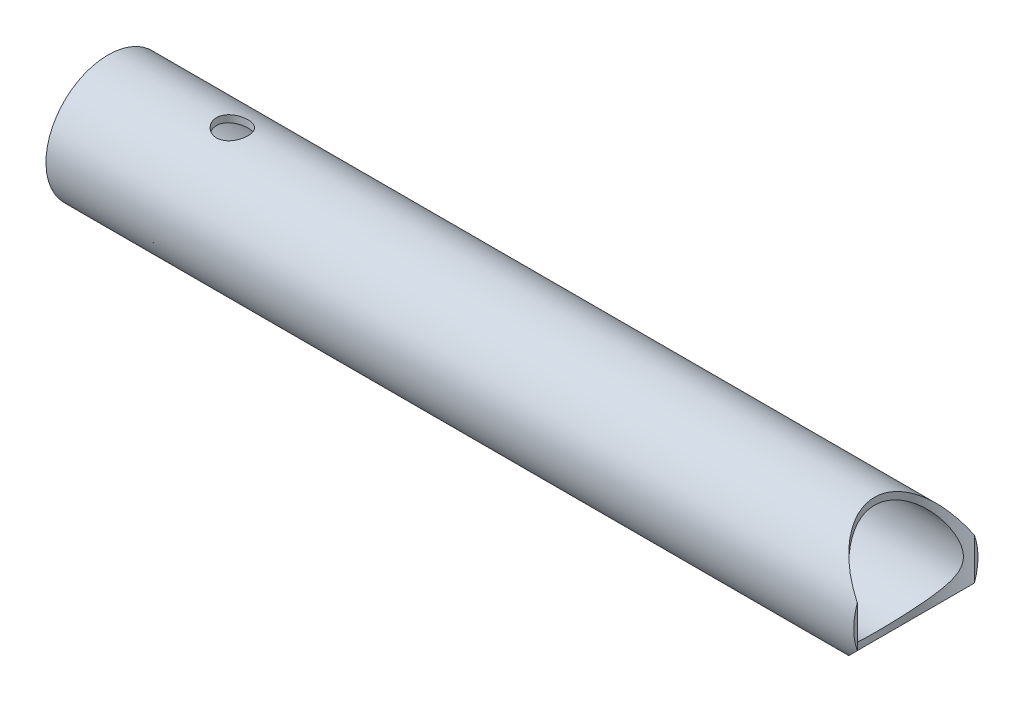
ISO-10303-21;
HEADER;
FILE_DESCRIPTION(('STEP AP214'),'2;1');
FILE_NAME('part.step','',(''),(''),'','','');
FILE_SCHEMA(('AUTOMOTIVE_DESIGN { 1 0 10303 214 1 1 1 1 }'));
ENDSEC;
DATA;
#1=APPLICATION_CONTEXT('core data for automotive mechanical design processes');
#2=APPLICATION_PROTOCOL_DEFINITION('international standard','automotive_design',2000,#1);
#3=PRODUCT_CONTEXT('',#1,'mechanical');
#4=PRODUCT('Part','Part','',(#3));
#5=PRODUCT_RELATED_PRODUCT_CATEGORY('part','',(#4));
#6=PRODUCT_DEFINITION_FORMATION('','',#4);
#7=PRODUCT_DEFINITION_CONTEXT('part definition',#1,'design');
#8=PRODUCT_DEFINITION('design','',#6,#7);
#9=PRODUCT_DEFINITION_SHAPE('','',#8);
#10=(LENGTH_UNIT() NAMED_UNIT(*) SI_UNIT(.MILLI.,.METRE.));
#11=(NAMED_UNIT(*) PLANE_ANGLE_UNIT() SI_UNIT($,.RADIAN.));
#12=(NAMED_UNIT(*) SI_UNIT($,.STERADIAN.) SOLID_ANGLE_UNIT());
#13=UNCERTAINTY_MEASURE_WITH_UNIT(LENGTH_MEASURE(1.E-05),#10,'distance_accuracy_value','');
#14=(GEOMETRIC_REPRESENTATION_CONTEXT(3) GLOBAL_UNCERTAINTY_ASSIGNED_CONTEXT((#13)) GLOBAL_UNIT_ASSIGNED_CONTEXT((#10,
#11,#12)) REPRESENTATION_CONTEXT('',''));
#15=CARTESIAN_POINT('',(0.,0.,0.));
#16=DIRECTION('',(0.,0.,1.));
#17=DIRECTION('',(1.,0.,0.));
#18=AXIS2_PLACEMENT_3D('',#15,#16,#17);
#19=CARTESIAN_POINT('',(123.825,0.,0.));
#20=DIRECTION('',(1.,0.,0.));
#21=DIRECTION('',(0.,0.,-1.));
#22=AXIS2_PLACEMENT_3D('',#19,#20,#21);
#23=PLANE('',#22);
#24=DIRECTION('',(0.,1.,0.));
#25=VECTOR('',#24,1.);
#26=CARTESIAN_POINT('',(123.825,-19.05,-17.9605122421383));
#27=LINE('',#26,#25);
#28=CARTESIAN_POINT('',(123.825,-6.34999999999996,-17.9605122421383));
#29=VERTEX_POINT('',#28);
#30=CARTESIAN_POINT('',(123.825,6.34999999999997,-17.9605122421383));
#31=VERTEX_POINT('',#30);
#32=EDGE_CURVE('E66',#29,#31,#27,.T.);
#33=ORIENTED_EDGE('',*,*,#32,.F.);
#34=CARTESIAN_POINT('',(123.825,0.,0.));
#35=DIRECTION('',(1.,0.,0.));
#36=DIRECTION('',(0.,0.,-1.));
#37=AXIS2_PLACEMENT_3D('',#34,#35,#36);
#38=CIRCLE('',#37,19.05);
#39=EDGE_CURVE('E44',#29,#31,#38,.T.);
#40=ORIENTED_EDGE('',*,*,#39,.T.);
#41=EDGE_LOOP('',(#33,#40));
#42=FACE_BOUND('',#41,.T.);
#43=ADVANCED_FACE('F30',(#42),#23,.T.);
#44=DIRECTION('',(0.,1.,0.));
#45=VECTOR('',#44,1.);
#46=CARTESIAN_POINT('',(123.825,-19.05,17.9605122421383));
#47=LINE('',#46,#45);
#48=CARTESIAN_POINT('',(123.825,-6.34999999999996,17.9605122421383));
#49=VERTEX_POINT('',#48);
#50=CARTESIAN_POINT('',(123.825,6.34999999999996,17.9605122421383));
#51=VERTEX_POINT('',#50);
#52=EDGE_CURVE('E68',#49,#51,#47,.T.);
#53=ORIENTED_EDGE('',*,*,#52,.T.);
#54=EDGE_CURVE('E11',#51,#49,#38,.T.);
#55=ORIENTED_EDGE('',*,*,#54,.T.);
#56=EDGE_LOOP('',(#53,#55));
#57=FACE_BOUND('',#56,.T.);
#58=ADVANCED_FACE('F114',(#57),#23,.T.);
#59=CARTESIAN_POINT('',(-123.825,0.,0.));
#60=DIRECTION('',(1.,0.,0.));
#61=DIRECTION('',(0.,0.,-1.));
#62=AXIS2_PLACEMENT_3D('',#59,#60,#61);
#63=PLANE('',#62);
#64=CARTESIAN_POINT('',(-123.825,0.,0.));
#65=DIRECTION('',(1.,0.,0.));
#66=DIRECTION('',(0.,0.,-1.));
#67=AXIS2_PLACEMENT_3D('',#64,#65,#66);
#68=CIRCLE('',#67,19.05);
#69=CARTESIAN_POINT('',(-123.825,0.,-19.05));
#70=VERTEX_POINT('',#69);
#71=EDGE_CURVE('E75',#70,#70,#68,.T.);
#72=ORIENTED_EDGE('',*,*,#71,.F.);
#73=EDGE_LOOP('',(#72));
#74=FACE_BOUND('',#73,.T.);
#75=CARTESIAN_POINT('',(-123.825,0.,0.));
#76=DIRECTION('',(1.,0.,0.));
#77=DIRECTION('',(0.,0.,-1.));
#78=AXIS2_PLACEMENT_3D('',#75,#76,#77);
#79=CIRCLE('',#78,16.9418);
#80=CARTESIAN_POINT('',(-123.825,0.,-16.9418));
#81=VERTEX_POINT('',#80);
#82=EDGE_CURVE('E69',#81,#81,#79,.T.);
#83=ORIENTED_EDGE('',*,*,#82,.T.);
#84=EDGE_LOOP('',(#83));
#85=FACE_BOUND('',#84,.T.);
#86=ADVANCED_FACE('F116',(#74,#85),#63,.F.);
#87=CARTESIAN_POINT('',(123.825,0.,0.));
#88=DIRECTION('',(-1.,0.,0.));
#89=DIRECTION('',(0.,0.,1.));
#90=AXIS2_PLACEMENT_3D('',#87,#88,#89);
#91=CYLINDRICAL_SURFACE('',#90,19.05);
#92=CARTESIAN_POINT('',(-90.551,-19.05,0.));
#93=CARTESIAN_POINT('',(-90.550992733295,-19.0499955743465,0.266523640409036));
#94=CARTESIAN_POINT('',(-90.528846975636,-19.044351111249,0.533127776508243));
#95=CARTESIAN_POINT('',(-90.4409864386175,-19.0223814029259,1.05868748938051));
#96=CARTESIAN_POINT('',(-90.3752476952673,-19.0060502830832,1.31763877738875));
#97=CARTESIAN_POINT('',(-90.2024516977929,-18.9645145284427,1.82022799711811));
#98=CARTESIAN_POINT('',(-90.0954447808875,-18.939320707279,2.06388416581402));
#99=CARTESIAN_POINT('',(-89.8433289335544,-18.8827386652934,2.52978809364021));
#100=CARTESIAN_POINT('',(-89.6982184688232,-18.8513501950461,2.7520349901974));
#101=CARTESIAN_POINT('',(-89.3707801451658,-18.7850421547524,3.1735020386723));
#102=CARTESIAN_POINT('',(-89.1877990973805,-18.7500669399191,3.3722059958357));
#103=CARTESIAN_POINT('',(-88.7912118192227,-18.6808945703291,3.73645917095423));
#104=CARTESIAN_POINT('',(-88.577602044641,-18.6466975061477,3.90200454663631));
#105=CARTESIAN_POINT('',(-88.1217909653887,-18.5823907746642,4.19768639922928));
#106=CARTESIAN_POINT('',(-87.879202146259,-18.5523516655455,4.32724224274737));
#107=CARTESIAN_POINT('',(-87.3748040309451,-18.5005747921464,4.5435323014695));
#108=CARTESIAN_POINT('',(-87.1129979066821,-18.4788356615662,4.63027356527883));
#109=CARTESIAN_POINT('',(-86.5832810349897,-18.44669254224,4.75670501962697));
#110=CARTESIAN_POINT('',(-86.3156060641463,-18.4360649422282,4.79732487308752));
#111=CARTESIAN_POINT('',(-85.7770461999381,-18.4266790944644,4.83325673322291));
#112=CARTESIAN_POINT('',(-85.5061618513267,-18.4279188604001,4.82857632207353));
#113=CARTESIAN_POINT('',(-84.9760231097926,-18.4419268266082,4.77478153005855));
#114=CARTESIAN_POINT('',(-84.7166471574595,-18.4544067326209,4.72677825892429));
#115=CARTESIAN_POINT('',(-84.2097555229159,-18.4890289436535,4.58947423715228));
#116=CARTESIAN_POINT('',(-83.9622407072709,-18.5111719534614,4.5001704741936));
#117=CARTESIAN_POINT('',(-83.4831342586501,-18.5628878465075,4.28186174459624));
#118=CARTESIAN_POINT('',(-83.2517335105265,-18.592535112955,4.15245621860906));
#119=CARTESIAN_POINT('',(-82.8135343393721,-18.6558774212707,3.85789731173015));
#120=CARTESIAN_POINT('',(-82.6067403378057,-18.6895731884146,3.69273752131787));
#121=CARTESIAN_POINT('',(-82.2172611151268,-18.7584270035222,3.32561742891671));
#122=CARTESIAN_POINT('',(-82.0354601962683,-18.7935989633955,3.12272037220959));
#123=CARTESIAN_POINT('',(-81.7082937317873,-18.8605525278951,2.68889519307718));
#124=CARTESIAN_POINT('',(-81.5629293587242,-18.8923340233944,2.45796616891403));
#125=CARTESIAN_POINT('',(-81.3124251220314,-18.9490909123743,1.97334955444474));
#126=CARTESIAN_POINT('',(-81.2074320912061,-18.9740413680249,1.71958295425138));
#127=CARTESIAN_POINT('',(-81.0418441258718,-19.0141438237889,1.19722795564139));
#128=CARTESIAN_POINT('',(-80.9812404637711,-19.0292977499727,0.928642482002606));
#129=CARTESIAN_POINT('',(-80.9075094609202,-19.0478134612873,0.391831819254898));
#130=CARTESIAN_POINT('',(-80.8931782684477,-19.0514741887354,0.123782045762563));
#131=CARTESIAN_POINT('',(-80.9090927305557,-19.0474440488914,-0.410886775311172));
#132=CARTESIAN_POINT('',(-80.9393342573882,-19.0397542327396,-0.677505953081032));
#133=CARTESIAN_POINT('',(-81.0425443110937,-19.0140789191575,-1.19753978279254));
#134=CARTESIAN_POINT('',(-81.1148532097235,-18.9962524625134,-1.45109391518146));
#135=CARTESIAN_POINT('',(-81.2993895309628,-18.9523154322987,-1.94245802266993));
#136=CARTESIAN_POINT('',(-81.4116210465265,-18.926204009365,-2.18026638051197));
#137=CARTESIAN_POINT('',(-81.6751302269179,-18.867880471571,-2.63815632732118));
#138=CARTESIAN_POINT('',(-81.827078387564,-18.8355664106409,-2.85783875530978));
#139=CARTESIAN_POINT('',(-82.1648533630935,-18.7685780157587,-3.26901378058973));
#140=CARTESIAN_POINT('',(-82.3506861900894,-18.7339032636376,-3.46050136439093));
#141=CARTESIAN_POINT('',(-82.7565508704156,-18.6650207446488,-3.81483413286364));
#142=CARTESIAN_POINT('',(-82.9773278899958,-18.6308468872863,-3.9768338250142));
#143=CARTESIAN_POINT('',(-83.4436408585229,-18.5678096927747,-4.26148813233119));
#144=CARTESIAN_POINT('',(-83.6891757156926,-18.5389461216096,-4.38414448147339));
#145=CARTESIAN_POINT('',(-84.196730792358,-18.4901188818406,-4.58571306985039));
#146=CARTESIAN_POINT('',(-84.4586429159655,-18.4701027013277,-4.6648841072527));
#147=CARTESIAN_POINT('',(-84.99264692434,-18.4411928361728,-4.77790476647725));
#148=CARTESIAN_POINT('',(-85.2647364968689,-18.4322966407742,-4.81176461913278));
#149=CARTESIAN_POINT('',(-85.8027580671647,-18.4268290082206,-4.83265643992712));
#150=CARTESIAN_POINT('',(-86.0686347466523,-18.4299015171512,-4.8210411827));
#151=CARTESIAN_POINT('',(-86.5945056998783,-18.4471998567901,-4.75441673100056));
#152=CARTESIAN_POINT('',(-86.8545000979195,-18.4614254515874,-4.69940845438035));
#153=CARTESIAN_POINT('',(-87.3597101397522,-18.4992259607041,-4.54830738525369));
#154=CARTESIAN_POINT('',(-87.6050083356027,-18.5227416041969,-4.45247475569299));
#155=CARTESIAN_POINT('',(-88.0762220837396,-18.576479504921,-4.22265020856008));
#156=CARTESIAN_POINT('',(-88.3021348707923,-18.6067027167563,-4.08865285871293));
#157=CARTESIAN_POINT('',(-88.734686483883,-18.6714602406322,-3.78208916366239));
#158=CARTESIAN_POINT('',(-88.9406482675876,-18.7060882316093,-3.60858717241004));
#159=CARTESIAN_POINT('',(-89.3209736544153,-18.7752016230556,-3.22975405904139));
#160=CARTESIAN_POINT('',(-89.4953297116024,-18.8096869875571,-3.02441535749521));
#161=CARTESIAN_POINT('',(-89.810684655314,-18.8754008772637,-2.58309455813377));
#162=CARTESIAN_POINT('',(-89.9509973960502,-18.9065562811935,-2.34661043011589));
#163=CARTESIAN_POINT('',(-90.1896527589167,-18.9613231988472,-1.85263998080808));
#164=CARTESIAN_POINT('',(-90.2880248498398,-18.9849400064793,-1.59516855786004));
#165=CARTESIAN_POINT('',(-90.4257473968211,-19.0185620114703,-1.11520835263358));
#166=CARTESIAN_POINT('',(-90.4726141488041,-19.0302693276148,-0.894965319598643));
#167=CARTESIAN_POINT('',(-90.5352422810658,-19.045989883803,-0.44983372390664));
#168=CARTESIAN_POINT('',(-90.5510061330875,-19.0500037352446,-0.224945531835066));
#169=CARTESIAN_POINT('',(-90.551,-19.05,0.));
#170=B_SPLINE_CURVE_WITH_KNOTS('',3,(#92,#93,#94,#95,#96,#97,#98,#99,#100,#101,#102,#103,#104,
#105,#106,#107,#108,#109,#110,#111,#112,#113,#114,#115,#116,#117,#118,#119,#120,#121,#122,#123,
#124,#125,#126,#127,#128,#129,#130,#131,#132,#133,#134,#135,#136,#137,#138,#139,#140,#141,#142,
#143,#144,#145,#146,#147,#148,#149,#150,#151,#152,#153,#154,#155,#156,#157,#158,#159,#160,#161,
#162,#163,#164,#165,#166,#167,#168,#169),.UNSPECIFIED.,.T.,.F.,(4,2,2,2,2,2,2,2,2,2,2,2,2,2,2,2,
2,2,2,2,2,2,2,2,2,2,2,2,2,2,2,2,2,2,2,2,2,2,4),(0.,0.798746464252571,1.59793238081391,
2.39614655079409,3.19439286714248,4.00776667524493,4.8212346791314,5.64715125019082,
6.47293180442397,7.28175406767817,8.09044095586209,8.87895891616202,9.66753439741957,
10.4642553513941,11.2611192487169,12.0813397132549,12.9015865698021,13.7247891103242,
14.5478297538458,15.3492775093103,16.1506510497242,16.9397851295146,17.7290001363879,
18.5325118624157,19.3361662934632,20.1601169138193,20.9840312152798,21.8029874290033,
22.6217586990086,23.4163612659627,24.21094702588,25.0005431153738,25.7902516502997,
26.6010800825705,27.4121018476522,28.2383181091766,29.0639528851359,29.7381472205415,
30.4122879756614),.UNSPECIFIED.);
#171=CARTESIAN_POINT('',(-90.551,-19.05,0.));
#172=VERTEX_POINT('',#171);
#173=EDGE_CURVE('E107',#172,#172,#170,.T.);
#174=ORIENTED_EDGE('',*,*,#173,.T.);
#175=EDGE_LOOP('',(#174));
#176=FACE_BOUND('',#175,.T.);
#177=CARTESIAN_POINT('',(-85.725,18.4285708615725,4.82599999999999));
#178=CARTESIAN_POINT('',(-85.9913688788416,18.4285758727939,4.82599264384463));
#179=CARTESIAN_POINT('',(-86.2578184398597,18.4344091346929,4.80387171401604));
#180=CARTESIAN_POINT('',(-86.7830575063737,18.457050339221,4.71611871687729));
#181=CARTESIAN_POINT('',(-87.0418425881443,18.4738644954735,4.65046201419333));
#182=CARTESIAN_POINT('',(-87.5440792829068,18.5164437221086,4.47790575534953));
#183=CARTESIAN_POINT('',(-87.7875505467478,18.5421970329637,4.37106036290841));
#184=CARTESIAN_POINT('',(-88.253141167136,18.5997381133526,4.11932558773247));
#185=CARTESIAN_POINT('',(-88.4752594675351,18.6315261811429,3.97443432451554));
#186=CARTESIAN_POINT('',(-88.8968569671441,18.6983591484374,3.64722361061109));
#187=CARTESIAN_POINT('',(-89.0957825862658,18.7334572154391,3.46420161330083));
#188=CARTESIAN_POINT('',(-89.4604677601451,18.8024947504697,3.06743753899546));
#189=CARTESIAN_POINT('',(-89.6262241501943,18.836434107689,2.85369253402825));
#190=CARTESIAN_POINT('',(-89.9221390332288,18.8999194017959,2.39774842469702));
#191=CARTESIAN_POINT('',(-90.0517524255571,18.9293952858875,2.15518494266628));
#192=CARTESIAN_POINT('',(-90.2681556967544,18.9800252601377,1.65084105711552));
#193=CARTESIAN_POINT('',(-90.3549520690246,19.0011806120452,1.38906357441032));
#194=CARTESIAN_POINT('',(-90.4814807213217,19.0324100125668,0.859495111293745));
#195=CARTESIAN_POINT('',(-90.5221533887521,19.0427051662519,0.591942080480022));
#196=CARTESIAN_POINT('',(-90.5582332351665,19.0518251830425,0.0536254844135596));
#197=CARTESIAN_POINT('',(-90.553647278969,19.0506517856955,-0.217137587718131));
#198=CARTESIAN_POINT('',(-90.5000136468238,19.0371309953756,-0.747661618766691));
#199=CARTESIAN_POINT('',(-90.4519812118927,19.0250387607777,-1.00753269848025));
#200=CARTESIAN_POINT('',(-90.3144515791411,18.9913368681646,-1.51539893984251));
#201=CARTESIAN_POINT('',(-90.2249521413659,18.9697266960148,-1.76339345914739));
#202=CARTESIAN_POINT('',(-90.0062161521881,18.9190290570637,-2.24312541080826));
#203=CARTESIAN_POINT('',(-89.8766209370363,18.889874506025,-2.47469192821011));
#204=CARTESIAN_POINT('',(-89.5816448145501,18.8272464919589,-2.91314471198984));
#205=CARTESIAN_POINT('',(-89.4162575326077,18.7937722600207,-3.12002657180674));
#206=CARTESIAN_POINT('',(-89.0489598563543,18.7250516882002,-3.50929331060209));
#207=CARTESIAN_POINT('',(-88.8461626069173,18.6897819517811,-3.6908381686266));
#208=CARTESIAN_POINT('',(-88.4126334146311,18.6222939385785,-4.01753343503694));
#209=CARTESIAN_POINT('',(-88.181900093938,18.5900758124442,-4.1626820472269));
#210=CARTESIAN_POINT('',(-87.6973668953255,18.5322530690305,-4.41302198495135));
#211=CARTESIAN_POINT('',(-87.4434555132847,18.5066829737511,-4.5180060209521));
#212=CARTESIAN_POINT('',(-86.920781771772,18.4654913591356,-4.6835332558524));
#213=CARTESIAN_POINT('',(-86.6520227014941,18.4498676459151,-4.74408625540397));
#214=CARTESIAN_POINT('',(-86.1150857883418,18.4307995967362,-4.81762824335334));
#215=CARTESIAN_POINT('',(-85.8470894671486,18.4270367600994,-4.8318614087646));
#216=CARTESIAN_POINT('',(-85.3125496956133,18.4312486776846,-4.81577014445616));
#217=CARTESIAN_POINT('',(-85.0460061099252,18.4392223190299,-4.78544993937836));
#218=CARTESIAN_POINT('',(-84.526591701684,18.4657030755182,-4.68220470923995));
#219=CARTESIAN_POINT('',(-84.2735659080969,18.4840298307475,-4.61000863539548));
#220=CARTESIAN_POINT('',(-83.7832093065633,18.5289796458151,-4.42587148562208));
#221=CARTESIAN_POINT('',(-83.5458804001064,18.5556037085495,-4.31392560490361));
#222=CARTESIAN_POINT('',(-83.0883957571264,18.6148155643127,-4.05087777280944));
#223=CARTESIAN_POINT('',(-82.8686806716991,18.6475123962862,-3.89903454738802));
#224=CARTESIAN_POINT('',(-82.4573921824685,18.7149203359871,-3.56143596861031));
#225=CARTESIAN_POINT('',(-82.2658235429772,18.7496317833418,-3.37567488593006));
#226=CARTESIAN_POINT('',(-81.9112016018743,18.8182406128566,-2.96979489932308));
#227=CARTESIAN_POINT('',(-81.7490103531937,18.8520939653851,-2.74891396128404));
#228=CARTESIAN_POINT('',(-81.46401938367,18.9142478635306,-2.28233090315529));
#229=CARTESIAN_POINT('',(-81.3412175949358,18.9425487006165,-2.03663008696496));
#230=CARTESIAN_POINT('',(-81.1395711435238,18.9902292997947,-1.52908971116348));
#231=CARTESIAN_POINT('',(-81.0604074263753,19.0096736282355,-1.26738326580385));
#232=CARTESIAN_POINT('',(-80.9473322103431,19.0377333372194,-0.733822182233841));
#233=CARTESIAN_POINT('',(-80.9134117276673,19.0463508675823,-0.461969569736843));
#234=CARTESIAN_POINT('',(-80.8923025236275,19.0516955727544,0.0760773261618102));
#235=CARTESIAN_POINT('',(-80.9038431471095,19.0487460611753,0.342219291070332));
#236=CARTESIAN_POINT('',(-80.970410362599,19.0320078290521,0.868641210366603));
#237=CARTESIAN_POINT('',(-81.0254355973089,19.0182194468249,1.12892134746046));
#238=CARTESIAN_POINT('',(-81.1767210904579,18.9814055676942,1.63486230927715));
#239=CARTESIAN_POINT('',(-81.2727460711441,18.9584328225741,1.88059757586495));
#240=CARTESIAN_POINT('',(-81.503092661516,18.9056658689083,2.35260810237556));
#241=CARTESIAN_POINT('',(-81.6374192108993,18.8758707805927,2.57888084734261));
#242=CARTESIAN_POINT('',(-81.944400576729,18.8117551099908,3.011547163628));
#243=CARTESIAN_POINT('',(-82.1179137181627,18.7773415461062,3.21731796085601));
#244=CARTESIAN_POINT('',(-82.4966839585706,18.7082773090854,3.59725312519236));
#245=CARTESIAN_POINT('',(-82.7019491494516,18.6736265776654,3.77140941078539));
#246=CARTESIAN_POINT('',(-83.1431635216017,18.6072484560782,4.08647635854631));
#247=CARTESIAN_POINT('',(-83.379628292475,18.5755903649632,4.22668077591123));
#248=CARTESIAN_POINT('',(-83.8735418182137,18.5197230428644,4.46513853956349));
#249=CARTESIAN_POINT('',(-84.1309754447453,18.4955085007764,4.56342181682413));
#250=CARTESIAN_POINT('',(-84.6107194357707,18.4609727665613,4.70095724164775));
#251=CARTESIAN_POINT('',(-84.8307744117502,18.4489148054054,4.74774455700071));
#252=CARTESIAN_POINT('',(-85.2755340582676,18.4327120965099,4.81026763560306));
#253=CARTESIAN_POINT('',(-85.5002383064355,18.4285666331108,4.82600620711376));
#254=CARTESIAN_POINT('',(-85.725,18.4285708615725,4.82599999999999));
#255=B_SPLINE_CURVE_WITH_KNOTS('',3,(#177,#178,#179,#180,#181,#182,#183,#184,#185,#186,#187,
#188,#189,#190,#191,#192,#193,#194,#195,#196,#197,#198,#199,#200,#201,#202,#203,#204,#205,#206,
#207,#208,#209,#210,#211,#212,#213,#214,#215,#216,#217,#218,#219,#220,#221,#222,#223,#224,#225,
#226,#227,#228,#229,#230,#231,#232,#233,#234,#235,#236,#237,#238,#239,#240,#241,#242,#243,#244,
#245,#246,#247,#248,#249,#250,#251,#252,#253,#254),.UNSPECIFIED.,.T.,.F.,(4,2,2,2,2,2,2,2,2,2,2,
2,2,2,2,2,2,2,2,2,2,2,2,2,2,2,2,2,2,2,2,2,2,2,2,2,2,2,4),(0.,0.79828103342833,1.59701417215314,
2.39470052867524,3.19242631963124,4.00640824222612,4.82046779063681,5.64621187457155,
6.4718306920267,7.28029552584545,8.08863773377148,8.87856548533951,9.66853591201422,
10.465787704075,11.2631816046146,12.0827235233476,12.9023058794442,13.7260628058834,
14.5496379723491,15.3509005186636,16.1520870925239,16.9397286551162,17.7274654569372,
18.5310235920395,19.3347175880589,20.1591226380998,20.9834844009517,21.801736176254,
22.6198254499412,23.4152132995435,24.2105763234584,25.0014352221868,25.792396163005,
26.6027334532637,27.4132775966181,28.2394598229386,29.0650511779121,29.7387005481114,
30.4122889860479),.UNSPECIFIED.);
#256=CARTESIAN_POINT('',(-85.725,18.4285708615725,4.82599999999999));
#257=VERTEX_POINT('',#256);
#258=EDGE_CURVE('E103',#257,#257,#255,.T.);
#259=ORIENTED_EDGE('',*,*,#258,.T.);
#260=EDGE_LOOP('',(#259));
#261=FACE_BOUND('',#260,.T.);
#262=ORIENTED_EDGE('',*,*,#39,.F.);
#263=CARTESIAN_POINT('',(130.175,0.,0.));
#264=DIRECTION('',(-0.707106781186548,0.707106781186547,0.));
#265=DIRECTION('',(-0.707106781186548,-0.707106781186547,0.));
#266=AXIS2_PLACEMENT_3D('',#263,#264,#265);
#267=ELLIPSE('',#266,26.9407683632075,19.05);
#268=EDGE_CURVE('E63',#29,#49,#267,.T.);
#269=ORIENTED_EDGE('',*,*,#268,.T.);
#270=ORIENTED_EDGE('',*,*,#54,.F.);
#271=CARTESIAN_POINT('',(130.175,0.,0.));
#272=DIRECTION('',(-0.707106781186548,-0.707106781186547,0.));
#273=DIRECTION('',(-0.707106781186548,0.707106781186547,0.));
#274=AXIS2_PLACEMENT_3D('',#271,#272,#273);
#275=ELLIPSE('',#274,26.9407683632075,19.05);
#276=EDGE_CURVE('E52',#51,#31,#275,.T.);
#277=ORIENTED_EDGE('',*,*,#276,.T.);
#278=EDGE_LOOP('',(#262,#269,#270,#277));
#279=FACE_BOUND('',#278,.T.);
#280=ORIENTED_EDGE('',*,*,#71,.T.);
#281=EDGE_LOOP('',(#280));
#282=FACE_BOUND('',#281,.T.);
#283=ADVANCED_FACE('F32',(#176,#261,#279,#282),#91,.T.);
#284=CARTESIAN_POINT('',(123.825,0.,0.));
#285=DIRECTION('',(-1.,0.,0.));
#286=DIRECTION('',(0.,0.,1.));
#287=AXIS2_PLACEMENT_3D('',#284,#285,#286);
#288=CYLINDRICAL_SURFACE('',#287,16.9418);
#289=CARTESIAN_POINT('',(-85.725,-16.2398987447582,4.82599999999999));
#290=CARTESIAN_POINT('',(-85.4598918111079,-16.2399025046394,4.82599514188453));
#291=CARTESIAN_POINT('',(-85.1947344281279,-16.2464614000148,4.80408071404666));
#292=CARTESIAN_POINT('',(-84.6721276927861,-16.2718960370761,4.71719958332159));
#293=CARTESIAN_POINT('',(-84.4146815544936,-16.290776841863,4.65221518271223));
#294=CARTESIAN_POINT('',(-83.9151353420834,-16.3385472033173,4.48154425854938));
#295=CARTESIAN_POINT('',(-83.6730122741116,-16.3674213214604,4.37592049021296));
#296=CARTESIAN_POINT('',(-83.2098729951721,-16.431904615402,4.12717112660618));
#297=CARTESIAN_POINT('',(-82.988859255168,-16.4675145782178,3.98404114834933));
#298=CARTESIAN_POINT('',(-82.5679066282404,-16.5425963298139,3.65997227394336));
#299=CARTESIAN_POINT('',(-82.3686591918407,-16.5821440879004,3.47815261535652));
#300=CARTESIAN_POINT('',(-82.0030319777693,-16.659993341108,3.08375626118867));
#301=CARTESIAN_POINT('',(-81.8366560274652,-16.6982946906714,2.87117598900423));
#302=CARTESIAN_POINT('',(-81.5385480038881,-16.7701914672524,2.41643196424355));
#303=CARTESIAN_POINT('',(-81.4075127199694,-16.8036868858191,2.17379423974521));
#304=CARTESIAN_POINT('',(-81.1883660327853,-16.8613202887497,1.66881437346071));
#305=CARTESIAN_POINT('',(-81.1002463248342,-16.8854600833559,1.40647605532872));
#306=CARTESIAN_POINT('',(-80.971696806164,-16.9211249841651,0.876768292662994));
#307=CARTESIAN_POINT('',(-80.9300886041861,-16.9329612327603,0.609706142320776));
#308=CARTESIAN_POINT('',(-80.89202584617,-16.9437774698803,0.0721471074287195));
#309=CARTESIAN_POINT('',(-80.8955627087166,-16.9427599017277,-0.198349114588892));
#310=CARTESIAN_POINT('',(-80.9468804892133,-16.9282068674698,-0.726861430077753));
#311=CARTESIAN_POINT('',(-80.9933867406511,-16.9150320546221,-0.985012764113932));
#312=CARTESIAN_POINT('',(-81.1272517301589,-16.8780771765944,-1.48968266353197));
#313=CARTESIAN_POINT('',(-81.2146129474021,-16.8542964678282,-1.73620052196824));
#314=CARTESIAN_POINT('',(-81.4286236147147,-16.7982862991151,-2.2137399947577));
#315=CARTESIAN_POINT('',(-81.5556905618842,-16.7659676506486,-2.44456361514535));
#316=CARTESIAN_POINT('',(-81.8451803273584,-16.6963353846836,-2.88203234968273));
#317=CARTESIAN_POINT('',(-82.0076108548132,-16.6590206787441,-3.08867217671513));
#318=CARTESIAN_POINT('',(-82.3699022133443,-16.5818770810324,-3.47951747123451));
#319=CARTESIAN_POINT('',(-82.5708713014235,-16.5420058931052,-3.66268859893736));
#320=CARTESIAN_POINT('',(-83.0010765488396,-16.4653984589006,-3.99300254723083));
#321=CARTESIAN_POINT('',(-83.2303149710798,-16.4286624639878,-4.14014248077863));
#322=CARTESIAN_POINT('',(-83.7130479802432,-16.3622969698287,-4.39515661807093));
#323=CARTESIAN_POINT('',(-83.9667197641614,-16.3327258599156,-4.50271168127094));
#324=CARTESIAN_POINT('',(-84.4896052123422,-16.2847439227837,-4.67329038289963));
#325=CARTESIAN_POINT('',(-84.7588143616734,-16.2663298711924,-4.73632688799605));
#326=CARTESIAN_POINT('',(-85.2953673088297,-16.2434450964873,-4.81421663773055));
#327=CARTESIAN_POINT('',(-85.5624658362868,-16.2385235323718,-4.83062851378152));
#328=CARTESIAN_POINT('',(-86.0955988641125,-16.2419403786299,-4.81912863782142));
#329=CARTESIAN_POINT('',(-86.361633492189,-16.2502771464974,-4.79122237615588));
#330=CARTESIAN_POINT('',(-86.8788213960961,-16.278832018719,-4.69326023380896));
#331=CARTESIAN_POINT('',(-87.1301754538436,-16.298775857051,-4.62417646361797));
#332=CARTESIAN_POINT('',(-87.6177187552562,-16.3480210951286,-4.446931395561));
#333=CARTESIAN_POINT('',(-87.8539058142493,-16.3773238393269,-4.33876448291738));
#334=CARTESIAN_POINT('',(-88.3108349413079,-16.4428832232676,-4.08337089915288));
#335=CARTESIAN_POINT('',(-88.531053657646,-16.479293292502,-3.93524822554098));
#336=CARTESIAN_POINT('',(-88.9440805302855,-16.554620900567,-3.60523332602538));
#337=CARTESIAN_POINT('',(-89.1368827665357,-16.5935389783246,-3.42333382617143));
#338=CARTESIAN_POINT('',(-89.4962576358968,-16.6710775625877,-3.02365578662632));
#339=CARTESIAN_POINT('',(-89.6617335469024,-16.7096443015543,-2.80487843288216));
#340=CARTESIAN_POINT('',(-89.9536318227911,-16.7808086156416,-2.34176245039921));
#341=CARTESIAN_POINT('',(-90.0800562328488,-16.8134065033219,-2.09742516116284));
#342=CARTESIAN_POINT('',(-90.2890573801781,-16.8687524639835,-1.59181882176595));
#343=CARTESIAN_POINT('',(-90.3719659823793,-16.8915748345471,-1.3306954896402));
#344=CARTESIAN_POINT('',(-90.4924930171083,-16.9251264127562,-0.797464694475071));
#345=CARTESIAN_POINT('',(-90.5301230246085,-16.9358587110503,-0.525360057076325));
#346=CARTESIAN_POINT('',(-90.558215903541,-16.943852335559,0.01192429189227));
#347=CARTESIAN_POINT('',(-90.550277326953,-16.941570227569,0.277014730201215));
#348=CARTESIAN_POINT('',(-90.4912284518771,-16.924847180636,0.801929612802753));
#349=CARTESIAN_POINT('',(-90.440120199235,-16.9104068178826,1.06175430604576));
#350=CARTESIAN_POINT('',(-90.2971346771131,-16.8711021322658,1.56655424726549));
#351=CARTESIAN_POINT('',(-90.2056217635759,-16.8463310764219,1.8116404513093));
#352=CARTESIAN_POINT('',(-89.9847487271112,-16.7889379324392,2.28311567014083));
#353=CARTESIAN_POINT('',(-89.8553827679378,-16.7563146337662,2.50950179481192));
#354=CARTESIAN_POINT('',(-89.5580238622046,-16.6854717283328,2.94442504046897));
#355=CARTESIAN_POINT('',(-89.3890008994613,-16.6471150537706,3.15223547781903));
#356=CARTESIAN_POINT('',(-89.019026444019,-16.5696185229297,3.53708134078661));
#357=CARTESIAN_POINT('',(-88.8180661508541,-16.5304784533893,3.71410825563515));
#358=CARTESIAN_POINT('',(-88.3836272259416,-16.4546575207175,4.03696749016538));
#359=CARTESIAN_POINT('',(-88.1494375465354,-16.4180673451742,4.18186647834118));
#360=CARTESIAN_POINT('',(-87.6590097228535,-16.3528543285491,4.43004628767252));
#361=CARTESIAN_POINT('',(-87.4027841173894,-16.3242269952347,4.53335058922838));
#362=CARTESIAN_POINT('',(-86.9109649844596,-16.2815559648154,4.68410013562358));
#363=CARTESIAN_POINT('',(-86.6772091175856,-16.2660718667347,4.73717648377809));
#364=CARTESIAN_POINT('',(-86.2039816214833,-16.2452423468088,4.80812587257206));
#365=CARTESIAN_POINT('',(-85.9645108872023,-16.2398953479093,4.82600438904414));
#366=CARTESIAN_POINT('',(-85.725,-16.2398987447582,4.82599999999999));
#367=B_SPLINE_CURVE_WITH_KNOTS('',3,(#289,#290,#291,#292,#293,#294,#295,#296,#297,#298,#299,
#300,#301,#302,#303,#304,#305,#306,#307,#308,#309,#310,#311,#312,#313,#314,#315,#316,#317,#318,
#319,#320,#321,#322,#323,#324,#325,#326,#327,#328,#329,#330,#331,#332,#333,#334,#335,#336,#337,
#338,#339,#340,#341,#342,#343,#344,#345,#346,#347,#348,#349,#350,#351,#352,#353,#354,#355,#356,
#357,#358,#359,#360,#361,#362,#363,#364,#365,#366),.UNSPECIFIED.,.T.,.F.,(4,2,2,2,2,2,2,2,2,2,2,
2,2,2,2,2,2,2,2,2,2,2,2,2,2,2,2,2,2,2,2,2,2,2,2,2,2,2,4),(0.,0.794442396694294,1.58921143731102,
2.38275809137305,3.17639752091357,3.99052759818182,4.80475241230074,5.63401913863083,
6.46312532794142,7.27071277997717,8.07814672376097,8.86237191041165,9.64664469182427,
10.4394583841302,11.2324450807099,12.0531003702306,12.8738213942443,13.701021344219,
14.5279821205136,15.3269529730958,16.1258248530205,16.9065451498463,17.6873776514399,
18.4874323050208,19.2876594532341,20.1147280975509,20.9417534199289,21.7623764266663,
22.5827896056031,23.3746025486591,24.1663779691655,24.9511547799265,25.7360526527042,
26.5441835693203,27.3525375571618,28.1819607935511,29.0109151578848,29.7287625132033,
30.4464981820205),.UNSPECIFIED.);
#368=CARTESIAN_POINT('',(-85.725,-16.2398987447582,4.82599999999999));
#369=VERTEX_POINT('',#368);
#370=EDGE_CURVE('E35',#369,#369,#367,.T.);
#371=ORIENTED_EDGE('',*,*,#370,.F.);
#372=EDGE_LOOP('',(#371));
#373=FACE_BOUND('',#372,.T.);
#374=CARTESIAN_POINT('',(-85.725,16.2398987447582,4.82599999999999));
#375=CARTESIAN_POINT('',(-85.9901081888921,16.2399025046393,4.82599514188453));
#376=CARTESIAN_POINT('',(-86.2552655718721,16.2464614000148,4.80408071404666));
#377=CARTESIAN_POINT('',(-86.7778723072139,16.2718960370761,4.71719958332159));
#378=CARTESIAN_POINT('',(-87.0353184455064,16.290776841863,4.65221518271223));
#379=CARTESIAN_POINT('',(-87.5348646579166,16.3385472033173,4.48154425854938));
#380=CARTESIAN_POINT('',(-87.7769877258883,16.3674213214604,4.37592049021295));
#381=CARTESIAN_POINT('',(-88.2401270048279,16.431904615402,4.12717112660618));
#382=CARTESIAN_POINT('',(-88.461140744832,16.4675145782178,3.98404114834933));
#383=CARTESIAN_POINT('',(-88.8820933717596,16.5425963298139,3.65997227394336));
#384=CARTESIAN_POINT('',(-89.0813408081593,16.5821440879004,3.47815261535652));
#385=CARTESIAN_POINT('',(-89.4469680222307,16.659993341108,3.08375626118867));
#386=CARTESIAN_POINT('',(-89.6133439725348,16.6982946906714,2.87117598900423));
#387=CARTESIAN_POINT('',(-89.9114519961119,16.7701914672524,2.41643196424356));
#388=CARTESIAN_POINT('',(-90.0424872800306,16.8036868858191,2.17379423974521));
#389=CARTESIAN_POINT('',(-90.2616339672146,16.8613202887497,1.66881437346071));
#390=CARTESIAN_POINT('',(-90.3497536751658,16.8854600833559,1.40647605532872));
#391=CARTESIAN_POINT('',(-90.478303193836,16.9211249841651,0.876768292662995));
#392=CARTESIAN_POINT('',(-90.5199113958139,16.9329612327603,0.609706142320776));
#393=CARTESIAN_POINT('',(-90.55797415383,16.9437774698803,0.0721471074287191));
#394=CARTESIAN_POINT('',(-90.5544372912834,16.9427599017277,-0.198349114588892));
#395=CARTESIAN_POINT('',(-90.5031195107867,16.9282068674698,-0.726861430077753));
#396=CARTESIAN_POINT('',(-90.4566132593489,16.9150320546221,-0.985012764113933));
#397=CARTESIAN_POINT('',(-90.3227482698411,16.8780771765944,-1.48968266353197));
#398=CARTESIAN_POINT('',(-90.2353870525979,16.8542964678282,-1.73620052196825));
#399=CARTESIAN_POINT('',(-90.0213763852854,16.7982862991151,-2.2137399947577));
#400=CARTESIAN_POINT('',(-89.8943094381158,16.7659676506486,-2.44456361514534));
#401=CARTESIAN_POINT('',(-89.6048196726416,16.6963353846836,-2.88203234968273));
#402=CARTESIAN_POINT('',(-89.4423891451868,16.6590206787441,-3.08867217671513));
#403=CARTESIAN_POINT('',(-89.0800977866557,16.5818770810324,-3.47951747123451));
#404=CARTESIAN_POINT('',(-88.8791286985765,16.5420058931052,-3.66268859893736));
#405=CARTESIAN_POINT('',(-88.4489234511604,16.4653984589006,-3.99300254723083));
#406=CARTESIAN_POINT('',(-88.2196850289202,16.4286624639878,-4.14014248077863));
#407=CARTESIAN_POINT('',(-87.7369520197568,16.3622969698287,-4.39515661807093));
#408=CARTESIAN_POINT('',(-87.4832802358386,16.3327258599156,-4.50271168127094));
#409=CARTESIAN_POINT('',(-86.9603947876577,16.2847439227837,-4.67329038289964));
#410=CARTESIAN_POINT('',(-86.6911856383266,16.2663298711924,-4.73632688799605));
#411=CARTESIAN_POINT('',(-86.1546326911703,16.2434450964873,-4.81421663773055));
#412=CARTESIAN_POINT('',(-85.8875341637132,16.2385235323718,-4.83062851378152));
#413=CARTESIAN_POINT('',(-85.3544011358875,16.2419403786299,-4.81912863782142));
#414=CARTESIAN_POINT('',(-85.088366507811,16.2502771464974,-4.79122237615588));
#415=CARTESIAN_POINT('',(-84.5711786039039,16.278832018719,-4.69326023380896));
#416=CARTESIAN_POINT('',(-84.3198245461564,16.298775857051,-4.62417646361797));
#417=CARTESIAN_POINT('',(-83.8322812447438,16.3480210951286,-4.446931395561));
#418=CARTESIAN_POINT('',(-83.5960941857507,16.3773238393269,-4.33876448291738));
#419=CARTESIAN_POINT('',(-83.1391650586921,16.4428832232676,-4.08337089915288));
#420=CARTESIAN_POINT('',(-82.918946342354,16.479293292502,-3.93524822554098));
#421=CARTESIAN_POINT('',(-82.5059194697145,16.554620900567,-3.60523332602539));
#422=CARTESIAN_POINT('',(-82.3131172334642,16.5935389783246,-3.42333382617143));
#423=CARTESIAN_POINT('',(-81.9537423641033,16.6710775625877,-3.02365578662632));
#424=CARTESIAN_POINT('',(-81.7882664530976,16.7096443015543,-2.80487843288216));
#425=CARTESIAN_POINT('',(-81.4963681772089,16.7808086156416,-2.34176245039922));
#426=CARTESIAN_POINT('',(-81.3699437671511,16.8134065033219,-2.09742516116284));
#427=CARTESIAN_POINT('',(-81.1609426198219,16.8687524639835,-1.59181882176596));
#428=CARTESIAN_POINT('',(-81.0780340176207,16.8915748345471,-1.33069548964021));
#429=CARTESIAN_POINT('',(-80.9575069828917,16.9251264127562,-0.797464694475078));
#430=CARTESIAN_POINT('',(-80.9198769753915,16.9358587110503,-0.52536005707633));
#431=CARTESIAN_POINT('',(-80.891784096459,16.943852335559,0.0119242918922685));
#432=CARTESIAN_POINT('',(-80.899722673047,16.941570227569,0.277014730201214));
#433=CARTESIAN_POINT('',(-80.9587715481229,16.924847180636,0.801929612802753));
#434=CARTESIAN_POINT('',(-81.009879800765,16.9104068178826,1.06175430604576));
#435=CARTESIAN_POINT('',(-81.1528653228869,16.8711021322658,1.5665542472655));
#436=CARTESIAN_POINT('',(-81.2443782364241,16.8463310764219,1.8116404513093));
#437=CARTESIAN_POINT('',(-81.4652512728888,16.7889379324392,2.28311567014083));
#438=CARTESIAN_POINT('',(-81.5946172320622,16.7563146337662,2.50950179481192));
#439=CARTESIAN_POINT('',(-81.8919761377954,16.6854717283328,2.94442504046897));
#440=CARTESIAN_POINT('',(-82.0609991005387,16.6471150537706,3.15223547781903));
#441=CARTESIAN_POINT('',(-82.4309735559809,16.5696185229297,3.53708134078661));
#442=CARTESIAN_POINT('',(-82.6319338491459,16.5304784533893,3.71410825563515));
#443=CARTESIAN_POINT('',(-83.0663727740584,16.4546575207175,4.03696749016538));
#444=CARTESIAN_POINT('',(-83.3005624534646,16.4180673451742,4.18186647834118));
#445=CARTESIAN_POINT('',(-83.7909902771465,16.3528543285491,4.43004628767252));
#446=CARTESIAN_POINT('',(-84.0472158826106,16.3242269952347,4.53335058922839));
#447=CARTESIAN_POINT('',(-84.5390350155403,16.2815559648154,4.68410013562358));
#448=CARTESIAN_POINT('',(-84.7727908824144,16.2660718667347,4.73717648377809));
#449=CARTESIAN_POINT('',(-85.2460183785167,16.2452423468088,4.80812587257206));
#450=CARTESIAN_POINT('',(-85.4854891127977,16.2398953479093,4.82600438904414));
#451=CARTESIAN_POINT('',(-85.725,16.2398987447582,4.82599999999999));
#452=B_SPLINE_CURVE_WITH_KNOTS('',3,(#374,#375,#376,#377,#378,#379,#380,#381,#382,#383,#384,
#385,#386,#387,#388,#389,#390,#391,#392,#393,#394,#395,#396,#397,#398,#399,#400,#401,#402,#403,
#404,#405,#406,#407,#408,#409,#410,#411,#412,#413,#414,#415,#416,#417,#418,#419,#420,#421,#422,
#423,#424,#425,#426,#427,#428,#429,#430,#431,#432,#433,#434,#435,#436,#437,#438,#439,#440,#441,
#442,#443,#444,#445,#446,#447,#448,#449,#450,#451),.UNSPECIFIED.,.T.,.F.,(4,2,2,2,2,2,2,2,2,2,2,
2,2,2,2,2,2,2,2,2,2,2,2,2,2,2,2,2,2,2,2,2,2,2,2,2,2,2,4),(0.,0.794442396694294,1.58921143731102,
2.38275809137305,3.17639752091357,3.99052759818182,4.80475241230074,5.63401913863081,
6.46312532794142,7.27071277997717,8.07814672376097,8.86237191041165,9.64664469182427,
10.4394583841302,11.2324450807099,12.0531003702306,12.8738213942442,13.701021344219,
14.5279821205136,15.3269529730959,16.1258248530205,16.9065451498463,17.6873776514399,
18.4874323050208,19.2876594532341,20.1147280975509,20.9417534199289,21.7623764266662,
22.5827896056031,23.3746025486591,24.1663779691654,24.9511547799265,25.7360526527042,
26.5441835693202,27.3525375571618,28.1819607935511,29.0109151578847,29.7287625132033,
30.4464981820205),.UNSPECIFIED.);
#453=CARTESIAN_POINT('',(-85.725,16.2398987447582,4.82599999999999));
#454=VERTEX_POINT('',#453);
#455=EDGE_CURVE('E84',#454,#454,#452,.T.);
#456=ORIENTED_EDGE('',*,*,#455,.F.);
#457=EDGE_LOOP('',(#456));
#458=FACE_BOUND('',#457,.T.);
#459=CARTESIAN_POINT('',(121.464207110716,0.,16.9418));
#460=CARTESIAN_POINT('',(121.464202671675,0.262189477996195,16.9417986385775));
#461=CARTESIAN_POINT('',(121.452301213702,0.52439999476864,16.9356945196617));
#462=CARTESIAN_POINT('',(121.405461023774,1.04618299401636,16.9114858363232));
#463=CARTESIAN_POINT('',(121.370518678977,1.30575505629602,16.8933793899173));
#464=CARTESIAN_POINT('',(121.279565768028,1.82080221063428,16.8456631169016));
#465=CARTESIAN_POINT('',(121.223496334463,2.07626375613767,16.8160211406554));
#466=CARTESIAN_POINT('',(121.093144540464,2.58103055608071,16.7459805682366));
#467=CARTESIAN_POINT('',(121.018853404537,2.83033278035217,16.7055767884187));
#468=CARTESIAN_POINT('',(120.817118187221,3.43618483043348,16.5937113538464));
#469=CARTESIAN_POINT('',(120.681009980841,3.78879033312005,16.5165393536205));
#470=CARTESIAN_POINT('',(120.385126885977,4.47896186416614,16.3428979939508));
#471=CARTESIAN_POINT('',(120.225337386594,4.8165184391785,16.2464167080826));
#472=CARTESIAN_POINT('',(119.888614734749,5.47843096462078,16.0353485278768));
#473=CARTESIAN_POINT('',(119.711629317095,5.80274212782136,15.9207057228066));
#474=CARTESIAN_POINT('',(119.346319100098,6.43816509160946,15.6745239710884));
#475=CARTESIAN_POINT('',(119.157995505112,6.74927828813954,15.5429868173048));
#476=CARTESIAN_POINT('',(118.807080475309,7.30685445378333,15.2876283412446));
#477=CARTESIAN_POINT('',(118.645639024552,7.55522835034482,15.1663756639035));
#478=CARTESIAN_POINT('',(118.319516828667,8.04410768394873,14.9128374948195));
#479=CARTESIAN_POINT('',(118.154835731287,8.28461225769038,14.7805507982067));
#480=CARTESIAN_POINT('',(117.65809265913,8.99501380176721,14.3671467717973));
#481=CARTESIAN_POINT('',(117.323427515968,9.45364852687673,14.0695545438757));
#482=CARTESIAN_POINT('',(116.657339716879,10.3409160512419,13.4308738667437));
#483=CARTESIAN_POINT('',(116.325913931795,10.7695809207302,13.0898330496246));
#484=CARTESIAN_POINT('',(115.67376624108,11.5962184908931,12.3634450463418));
#485=CARTESIAN_POINT('',(115.353039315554,11.9942057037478,11.9781190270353));
#486=CARTESIAN_POINT('',(114.80353893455,12.6661649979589,11.2593954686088));
#487=CARTESIAN_POINT('',(114.571013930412,12.9471455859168,10.9353918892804));
#488=CARTESIAN_POINT('',(114.119564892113,13.4878179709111,10.2610948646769));
#489=CARTESIAN_POINT('',(113.900640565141,13.7475102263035,9.91080198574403));
#490=CARTESIAN_POINT('',(113.480078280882,14.2428782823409,9.18465560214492));
#491=CARTESIAN_POINT('',(113.278416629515,14.478587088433,8.8088384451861));
#492=CARTESIAN_POINT('',(112.895592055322,14.9235681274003,8.03193403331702));
#493=CARTESIAN_POINT('',(112.71442484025,15.1328458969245,7.63085209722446));
#494=CARTESIAN_POINT('',(112.408747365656,15.4844383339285,6.88424125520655));
#495=CARTESIAN_POINT('',(112.280039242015,15.6318933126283,6.54284477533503));
#496=CARTESIAN_POINT('',(112.040338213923,15.9057357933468,5.84571040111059));
#497=CARTESIAN_POINT('',(111.929341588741,16.0321277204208,5.48997553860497));
#498=CARTESIAN_POINT('',(111.726959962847,16.2620800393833,4.76587616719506));
#499=CARTESIAN_POINT('',(111.635568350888,16.3656481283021,4.39751596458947));
#500=CARTESIAN_POINT('',(111.474069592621,16.5483749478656,3.65018146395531));
#501=CARTESIAN_POINT('',(111.403962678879,16.6275334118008,3.27120705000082));
#502=CARTESIAN_POINT('',(111.286140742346,16.7604308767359,2.50306298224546));
#503=CARTESIAN_POINT('',(111.238557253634,16.8140205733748,2.11384711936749));
#504=CARTESIAN_POINT('',(111.167445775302,16.8940682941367,1.33043711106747));
#505=CARTESIAN_POINT('',(111.143917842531,16.9205262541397,0.936242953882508));
#506=CARTESIAN_POINT('',(111.121466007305,16.9457746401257,0.146352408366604));
#507=CARTESIAN_POINT('',(111.12253678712,16.9445710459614,-0.249343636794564));
#508=CARTESIAN_POINT('',(111.149246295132,16.9145333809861,-1.03883195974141));
#509=CARTESIAN_POINT('',(111.174883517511,16.8857010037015,-1.43262435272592));
#510=CARTESIAN_POINT('',(111.246655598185,16.8048985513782,-2.17890587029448));
#511=CARTESIAN_POINT('',(111.290686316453,16.7553027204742,-2.53186015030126));
#512=CARTESIAN_POINT('',(111.397687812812,16.6346121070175,-3.23111970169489));
#513=CARTESIAN_POINT('',(111.460657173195,16.5635189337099,-3.57742546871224));
#514=CARTESIAN_POINT('',(111.604463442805,16.4008645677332,-4.26143728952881));
#515=CARTESIAN_POINT('',(111.685302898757,16.3093004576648,-4.59914210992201));
#516=CARTESIAN_POINT('',(111.863560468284,16.1069301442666,-5.26424181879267));
#517=CARTESIAN_POINT('',(111.960979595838,15.9961227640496,-5.59163607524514));
#518=CARTESIAN_POINT('',(112.177384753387,15.7492850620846,-6.25437035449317));
#519=CARTESIAN_POINT('',(112.297323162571,15.6121293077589,-6.58897916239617));
#520=CARTESIAN_POINT('',(112.552508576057,15.3192511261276,-7.24388219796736));
#521=CARTESIAN_POINT('',(112.687755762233,15.1635284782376,-7.56417625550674));
#522=CARTESIAN_POINT('',(112.971792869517,14.8350675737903,-8.18963546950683));
#523=CARTESIAN_POINT('',(113.120582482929,14.6623297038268,-8.49480096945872));
#524=CARTESIAN_POINT('',(113.429994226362,14.3012571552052,-9.08953823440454));
#525=CARTESIAN_POINT('',(113.590618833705,14.11291921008,-9.3791067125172));
#526=CARTESIAN_POINT('',(114.008651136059,13.6197629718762,-10.0895547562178));
#527=CARTESIAN_POINT('',(114.272774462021,13.3055034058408,-10.4999855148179));
#528=CARTESIAN_POINT('',(114.81899620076,12.6476322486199,-11.2837951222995));
#529=CARTESIAN_POINT('',(115.101102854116,12.3040071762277,-11.657156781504));
#530=CARTESIAN_POINT('',(115.679031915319,11.5887800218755,-12.3685185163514));
#531=CARTESIAN_POINT('',(115.974907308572,11.2170657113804,-12.7063622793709));
#532=CARTESIAN_POINT('',(116.573632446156,10.4487954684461,-13.3452942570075));
#533=CARTESIAN_POINT('',(116.876480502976,10.0522455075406,-13.6463912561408));
#534=CARTESIAN_POINT('',(117.490337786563,9.22505019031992,-14.2190777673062));
#535=CARTESIAN_POINT('',(117.80136963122,8.79381780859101,-14.4897939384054));
#536=CARTESIAN_POINT('',(118.416776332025,7.90452729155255,-14.9934830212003));
#537=CARTESIAN_POINT('',(118.721145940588,7.44644898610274,-15.226427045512));
#538=CARTESIAN_POINT('',(119.163332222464,6.73886208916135,-15.5460193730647));
#539=CARTESIAN_POINT('',(119.3080013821,6.50018798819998,-15.647370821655));
#540=CARTESIAN_POINT('',(119.591015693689,6.01512333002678,-15.8401716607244));
#541=CARTESIAN_POINT('',(119.729360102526,5.76873187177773,-15.9316198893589));
#542=CARTESIAN_POINT('',(119.997242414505,5.26815504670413,-16.104070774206));
#543=CARTESIAN_POINT('',(120.126793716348,5.01398243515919,-16.185089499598));
#544=CARTESIAN_POINT('',(120.374493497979,4.49705053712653,-16.3362665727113));
#545=CARTESIAN_POINT('',(120.492646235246,4.23429450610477,-16.4064289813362));
#546=CARTESIAN_POINT('',(120.697257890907,3.740604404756,-16.5253353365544));
#547=CARTESIAN_POINT('',(120.78580188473,3.51093311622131,-16.5757138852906));
#548=CARTESIAN_POINT('',(120.949833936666,3.04520162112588,-16.6675628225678));
#549=CARTESIAN_POINT('',(121.025323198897,2.80914200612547,-16.7090340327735));
#550=CARTESIAN_POINT('',(121.160422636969,2.33172163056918,-16.7823062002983));
#551=CARTESIAN_POINT('',(121.220076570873,2.09037751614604,-16.8141338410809));
#552=CARTESIAN_POINT('',(121.321181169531,1.60281213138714,-16.8675926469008));
#553=CARTESIAN_POINT('',(121.362637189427,1.35659231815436,-16.8892268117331));
#554=CARTESIAN_POINT('',(121.425597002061,0.857899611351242,-16.9219308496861));
#555=CARTESIAN_POINT('',(121.446859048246,0.605387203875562,-16.9328727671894));
#556=CARTESIAN_POINT('',(121.467311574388,0.0992368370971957,-16.9433999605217));
#557=CARTESIAN_POINT('',(121.466503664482,-0.154401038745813,-16.9429860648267));
#558=CARTESIAN_POINT('',(121.4428557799,-0.660640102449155,-16.9308099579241));
#559=CARTESIAN_POINT('',(121.419991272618,-0.913239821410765,-16.919035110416));
#560=CARTESIAN_POINT('',(121.353547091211,-1.41492523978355,-16.8844853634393));
#561=CARTESIAN_POINT('',(121.309963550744,-1.66401027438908,-16.8617084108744));
#562=CARTESIAN_POINT('',(121.193707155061,-2.20667079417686,-16.8001196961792));
#563=CARTESIAN_POINT('',(121.116943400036,-2.49910257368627,-16.7590023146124));
#564=CARTESIAN_POINT('',(120.941439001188,-3.07509006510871,-16.662947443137));
#565=CARTESIAN_POINT('',(120.842679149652,-3.35863777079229,-16.6079978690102));
#566=CARTESIAN_POINT('',(120.627514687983,-3.91703611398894,-16.485247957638));
#567=CARTESIAN_POINT('',(120.511056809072,-4.19185736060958,-16.4174086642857));
#568=CARTESIAN_POINT('',(120.264789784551,-4.73203363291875,-16.2699362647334));
#569=CARTESIAN_POINT('',(120.134983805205,-4.99739088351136,-16.1903059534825));
#570=CARTESIAN_POINT('',(119.877389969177,-5.49583511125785,-16.027564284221));
#571=CARTESIAN_POINT('',(119.750463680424,-5.72968296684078,-15.9454043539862));
#572=CARTESIAN_POINT('',(119.490251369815,-6.19047894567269,-15.7722262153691));
#573=CARTESIAN_POINT('',(119.356964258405,-6.41742587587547,-15.6812064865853));
#574=CARTESIAN_POINT('',(118.949971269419,-7.08876973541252,-15.3951595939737));
#575=CARTESIAN_POINT('',(118.669240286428,-7.52347005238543,-15.1872106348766));
#576=CARTESIAN_POINT('',(118.098800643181,-8.36983487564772,-14.737715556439));
#577=CARTESIAN_POINT('',(117.809079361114,-8.7814644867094,-14.4961203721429));
#578=CARTESIAN_POINT('',(117.228224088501,-9.58211238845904,-13.979788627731));
#579=CARTESIAN_POINT('',(116.937090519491,-9.971137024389,-13.7050614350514));
#580=CARTESIAN_POINT('',(116.337670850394,-10.7546249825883,-13.1005793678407));
#581=CARTESIAN_POINT('',(116.029708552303,-11.1473627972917,-12.7682574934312));
#582=CARTESIAN_POINT('',(115.424823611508,-11.9055417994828,-12.0644213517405));
#583=CARTESIAN_POINT('',(115.127903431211,-12.2709769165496,-11.6928984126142));
#584=CARTESIAN_POINT('',(114.551758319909,-12.9710118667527,-10.9110913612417));
#585=CARTESIAN_POINT('',(114.272491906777,-13.3056848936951,-10.5009042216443));
#586=CARTESIAN_POINT('',(113.871026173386,-13.7821954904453,-9.85631941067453));
#587=CARTESIAN_POINT('',(113.740128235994,-13.9367612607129,-9.63660893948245));
#588=CARTESIAN_POINT('',(113.484841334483,-14.2369142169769,-9.18737467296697));
#589=CARTESIAN_POINT('',(113.360453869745,-14.3824993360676,-8.9578486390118));
#590=CARTESIAN_POINT('',(113.072452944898,-14.7183312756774,-8.39873846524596));
#591=CARTESIAN_POINT('',(112.912219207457,-14.9041405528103,-8.06471368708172));
#592=CARTESIAN_POINT('',(112.608168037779,-15.2552737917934,-7.37899297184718));
#593=CARTESIAN_POINT('',(112.464346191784,-15.4206032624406,-7.02730182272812));
#594=CARTESIAN_POINT('',(112.195380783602,-15.7287777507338,-6.3074052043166));
#595=CARTESIAN_POINT('',(112.070231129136,-15.8716301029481,-5.93920517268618));
#596=CARTESIAN_POINT('',(111.840798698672,-16.132852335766,-5.18785431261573));
#597=CARTESIAN_POINT('',(111.736516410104,-16.2512216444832,-4.80470313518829));
#598=CARTESIAN_POINT('',(111.550157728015,-16.4623607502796,-4.02252102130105));
#599=CARTESIAN_POINT('',(111.468271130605,-16.5549118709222,-3.62338535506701));
#600=CARTESIAN_POINT('',(111.329702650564,-16.7113326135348,-2.81519576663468));
#601=CARTESIAN_POINT('',(111.273020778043,-16.7752022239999,-2.40614184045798));
#602=CARTESIAN_POINT('',(111.186273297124,-16.8728875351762,-1.58189083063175));
#603=CARTESIAN_POINT('',(111.156192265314,-16.9067206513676,-1.16669744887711));
#604=CARTESIAN_POINT('',(111.123369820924,-16.943635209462,-0.333888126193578));
#605=CARTESIAN_POINT('',(111.12062524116,-16.9467202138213,0.0837275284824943));
#606=CARTESIAN_POINT('',(111.141178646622,-16.9236065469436,0.865968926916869));
#607=CARTESIAN_POINT('',(111.161313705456,-16.9009644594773,1.23079194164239));
#608=CARTESIAN_POINT('',(111.22223568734,-16.8323976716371,1.95646837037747));
#609=CARTESIAN_POINT('',(111.263020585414,-16.7864752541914,2.31732217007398));
#610=CARTESIAN_POINT('',(111.364461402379,-16.6721068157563,3.03259697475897));
#611=CARTESIAN_POINT('',(111.425118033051,-16.6036599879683,3.38701774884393));
#612=CARTESIAN_POINT('',(111.565204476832,-16.4453014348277,4.08723792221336));
#613=CARTESIAN_POINT('',(111.644635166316,-16.3553887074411,4.43303691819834));
#614=CARTESIAN_POINT('',(111.821472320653,-16.1547616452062,5.11622890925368));
#615=CARTESIAN_POINT('',(111.918985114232,-16.0439241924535,5.45355803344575));
#616=CARTESIAN_POINT('',(112.130150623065,-15.8032278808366,6.116111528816));
#617=CARTESIAN_POINT('',(112.243802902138,-15.673369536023,6.44133622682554));
#618=CARTESIAN_POINT('',(112.485698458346,-15.3960410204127,7.07865181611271));
#619=CARTESIAN_POINT('',(112.613945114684,-15.2485667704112,7.39073964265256));
#620=CARTESIAN_POINT('',(112.883424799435,-14.9374262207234,8.0009521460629));
#621=CARTESIAN_POINT('',(113.024660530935,-14.7737565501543,8.29907389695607));
#622=CARTESIAN_POINT('',(113.388369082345,-14.3502554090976,9.01900750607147));
#623=CARTESIAN_POINT('',(113.617566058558,-14.0816718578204,9.43231703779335));
#624=CARTESIAN_POINT('',(114.095978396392,-13.5159109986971,10.2265682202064));
#625=CARTESIAN_POINT('',(114.345201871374,-13.2187220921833,10.6074966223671));
#626=CARTESIAN_POINT('',(114.859588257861,-12.5981802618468,11.3375689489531));
#627=CARTESIAN_POINT('',(115.124785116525,-12.2747710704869,11.6866409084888));
#628=CARTESIAN_POINT('',(115.66610238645,-11.6047071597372,12.3522623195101));
#629=CARTESIAN_POINT('',(115.942221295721,-11.2580556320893,12.6688162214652));
#630=CARTESIAN_POINT('',(116.50691066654,-10.5352188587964,13.2763497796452));
#631=CARTESIAN_POINT('',(116.795621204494,-10.1585587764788,13.5666329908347));
#632=CARTESIAN_POINT('',(117.374600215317,-9.38291392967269,14.1142122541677));
#633=CARTESIAN_POINT('',(117.664869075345,-8.98392336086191,14.3714996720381));
#634=CARTESIAN_POINT('',(118.240229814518,-8.16371610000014,14.8527507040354));
#635=CARTESIAN_POINT('',(118.525327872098,-7.74252865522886,15.0767567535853));
#636=CARTESIAN_POINT('',(119.082457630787,-6.87583885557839,15.4912278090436));
#637=CARTESIAN_POINT('',(119.354497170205,-6.43035143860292,15.6817131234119));
#638=CARTESIAN_POINT('',(119.756437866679,-5.71938228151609,15.9494679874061));
#639=CARTESIAN_POINT('',(119.895067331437,-5.46342290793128,16.0390285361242));
#640=CARTESIAN_POINT('',(120.162096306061,-4.94270781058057,16.2070687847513));
#641=CARTESIAN_POINT('',(120.290498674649,-4.67795457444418,16.2855515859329));
#642=CARTESIAN_POINT('',(120.533634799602,-4.13951744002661,16.4306605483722));
#643=CARTESIAN_POINT('',(120.648388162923,-3.86584708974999,16.4973037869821));
#644=CARTESIAN_POINT('',(120.860406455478,-3.30906539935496,16.6179340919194));
#645=CARTESIAN_POINT('',(120.957676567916,-3.0259568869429,16.6719249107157));
#646=CARTESIAN_POINT('',(121.110022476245,-2.51795759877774,16.7551298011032));
#647=CARTESIAN_POINT('',(121.16964763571,-2.29490005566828,16.7871855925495));
#648=CARTESIAN_POINT('',(121.273809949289,-1.84425568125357,16.8426484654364));
#649=CARTESIAN_POINT('',(121.318351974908,-1.61667033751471,16.8660583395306));
#650=CARTESIAN_POINT('',(121.390411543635,-1.1585006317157,16.9037029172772));
#651=CARTESIAN_POINT('',(121.417962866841,-0.927923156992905,16.917955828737));
#652=CARTESIAN_POINT('',(121.454863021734,-0.464902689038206,16.93700518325));
#653=CARTESIAN_POINT('',(121.464211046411,-0.23245961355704,16.9418012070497));
#654=CARTESIAN_POINT('',(121.464207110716,0.,16.9418));
#655=B_SPLINE_CURVE_WITH_KNOTS('',3,(#459,#460,#461,#462,#463,#464,#465,#466,#467,#468,#469,
#470,#471,#472,#473,#474,#475,#476,#477,#478,#479,#480,#481,#482,#483,#484,#485,#486,#487,#488,
#489,#490,#491,#492,#493,#494,#495,#496,#497,#498,#499,#500,#501,#502,#503,#504,#505,#506,#507,
#508,#509,#510,#511,#512,#513,#514,#515,#516,#517,#518,#519,#520,#521,#522,#523,#524,#525,#526,
#527,#528,#529,#530,#531,#532,#533,#534,#535,#536,#537,#538,#539,#540,#541,#542,#543,#544,#545,
#546,#547,#548,#549,#550,#551,#552,#553,#554,#555,#556,#557,#558,#559,#560,#561,#562,#563,#564,
#565,#566,#567,#568,#569,#570,#571,#572,#573,#574,#575,#576,#577,#578,#579,#580,#581,#582,#583,
#584,#585,#586,#587,#588,#589,#590,#591,#592,#593,#594,#595,#596,#597,#598,#599,#600,#601,#602,
#603,#604,#605,#606,#607,#608,#609,#610,#611,#612,#613,#614,#615,#616,#617,#618,#619,#620,#621,
#622,#623,#624,#625,#626,#627,#628,#629,#630,#631,#632,#633,#634,#635,#636,#637,#638,#639,#640,
#641,#642,#643,#644,#645,#646,#647,#648,#649,#650,#651,#652,#653,#654),.UNSPECIFIED.,.T.,.F.,(4,
2,2,2,2,2,2,2,2,2,2,2,2,2,2,2,2,2,2,2,2,2,2,2,2,2,2,2,2,2,2,2,2,2,2,2,2,2,2,2,2,2,2,2,2,2,2,2,2,
2,2,2,2,2,2,2,2,2,2,2,2,2,2,2,2,2,2,2,2,2,2,2,2,2,2,2,2,2,2,2,2,2,2,2,2,2,2,2,2,2,2,2,2,2,2,2,2,
4),(0.,0.786276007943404,1.57267533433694,2.36128224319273,3.15026968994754,4.30555978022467,
5.46156565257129,6.62120206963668,7.7807155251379,8.74065763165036,9.70070469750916,
11.6213710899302,13.5399497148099,15.457615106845,16.919949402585,18.382252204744,
19.8425146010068,21.3024705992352,22.4819205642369,23.661122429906,24.8399260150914,
26.0187424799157,27.2043606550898,28.389981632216,29.575346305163,30.7606383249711,
31.8368193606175,32.9129198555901,33.989173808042,35.06549360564,36.2073905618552,
37.349301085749,38.4911856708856,39.6333099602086,41.3722265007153,43.1119456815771,
44.859026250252,46.6056883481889,48.3939412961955,50.1835554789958,51.0740794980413,
51.9647078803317,52.8539471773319,53.7428530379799,54.4961104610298,55.249298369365,
56.0003827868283,56.7512460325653,57.5109887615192,58.2706760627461,59.0312093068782,
59.7918845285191,60.7057693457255,61.620455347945,62.5379510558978,63.4552296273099,
64.2903075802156,65.1255290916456,66.7966769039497,68.4702877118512,70.1434264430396,
71.940302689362,73.7375772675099,75.5304583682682,76.4266301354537,77.3230073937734,
78.565192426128,79.8070425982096,81.048486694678,82.2899597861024,83.5416490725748,
84.7933388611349,86.0443024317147,87.2951210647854,88.3920291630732,89.4888297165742,
90.5856695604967,91.6825606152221,92.7861189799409,93.8896475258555,94.9934321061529,
96.0974469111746,97.7258092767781,99.3548347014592,100.987453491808,102.619848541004,
104.287351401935,105.955289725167,107.621082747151,109.285863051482,110.199135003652,
111.112150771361,112.023838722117,112.935255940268,113.633963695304,114.332445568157,
115.029534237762,115.726653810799),.UNSPECIFIED.);
#656=CARTESIAN_POINT('',(121.464207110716,0.,16.9418));
#657=VERTEX_POINT('',#656);
#658=EDGE_CURVE('E72',#657,#657,#655,.T.);
#659=ORIENTED_EDGE('',*,*,#658,.F.);
#660=EDGE_LOOP('',(#659));
#661=FACE_BOUND('',#660,.T.);
#662=ORIENTED_EDGE('',*,*,#82,.F.);
#663=EDGE_LOOP('',(#662));
#664=FACE_BOUND('',#663,.T.);
#665=ADVANCED_FACE('F87',(#373,#458,#661,#664),#288,.F.);
#666=CARTESIAN_POINT('',(130.175,-19.05,0.));
#667=DIRECTION('',(0.,1.,0.));
#668=DIRECTION('',(0.,0.,1.));
#669=AXIS2_PLACEMENT_3D('',#666,#667,#668);
#670=CYLINDRICAL_SURFACE('',#669,19.05);
#671=ORIENTED_EDGE('',*,*,#658,.T.);
#672=EDGE_LOOP('',(#671));
#673=FACE_BOUND('',#672,.T.);
#674=ORIENTED_EDGE('',*,*,#32,.T.);
#675=ORIENTED_EDGE('',*,*,#276,.F.);
#676=ORIENTED_EDGE('',*,*,#52,.F.);
#677=ORIENTED_EDGE('',*,*,#268,.F.);
#678=EDGE_LOOP('',(#674,#675,#676,#677));
#679=FACE_BOUND('',#678,.T.);
#680=ADVANCED_FACE('F65',(#673,#679),#670,.F.);
#681=CARTESIAN_POINT('',(-85.725,-19.05,0.));
#682=DIRECTION('',(0.,1.,0.));
#683=DIRECTION('',(0.,0.,1.));
#684=AXIS2_PLACEMENT_3D('',#681,#682,#683);
#685=CYLINDRICAL_SURFACE('',#684,4.82599999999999);
#686=ORIENTED_EDGE('',*,*,#455,.T.);
#687=EDGE_LOOP('',(#686));
#688=FACE_BOUND('',#687,.T.);
#689=ORIENTED_EDGE('',*,*,#258,.F.);
#690=EDGE_LOOP('',(#689));
#691=FACE_BOUND('',#690,.T.);
#692=ADVANCED_FACE('F92',(#688,#691),#685,.F.);
#693=ORIENTED_EDGE('',*,*,#370,.T.);
#694=EDGE_LOOP('',(#693));
#695=FACE_BOUND('',#694,.T.);
#696=ORIENTED_EDGE('',*,*,#173,.F.);
#697=EDGE_LOOP('',(#696));
#698=FACE_BOUND('',#697,.T.);
#699=ADVANCED_FACE('F94',(#695,#698),#685,.F.);
#700=CLOSED_SHELL('',(#43,#58,#86,#283,#665,#680,#692,#699));
#701=MANIFOLD_SOLID_BREP('B2',#700);
#702=ADVANCED_BREP_SHAPE_REPRESENTATION('',(#18,#701),#14);
#703=SHAPE_DEFINITION_REPRESENTATION(#9,#702);
ENDSEC;
END-ISO-10303-21;
